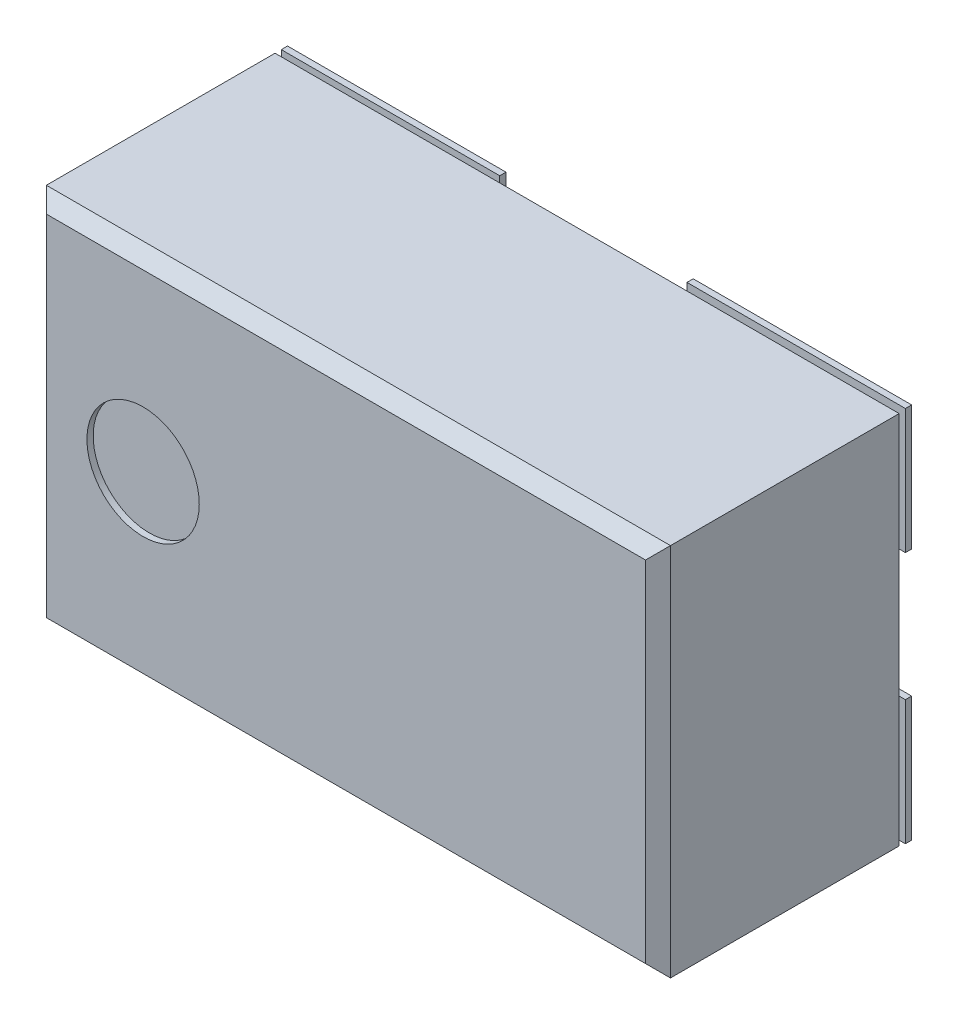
ISO-10303-21;
HEADER;
FILE_DESCRIPTION(('STEP AP214'),'2;1');
FILE_NAME('part.step','',(''),(''),'','','');
FILE_SCHEMA(('AUTOMOTIVE_DESIGN { 1 0 10303 214 1 1 1 1 }'));
ENDSEC;
DATA;
#1=APPLICATION_CONTEXT('core data for automotive mechanical design processes');
#2=APPLICATION_PROTOCOL_DEFINITION('international standard','automotive_design',2000,#1);
#3=PRODUCT_CONTEXT('',#1,'mechanical');
#4=PRODUCT('Part','Part','',(#3));
#5=PRODUCT_RELATED_PRODUCT_CATEGORY('part','',(#4));
#6=PRODUCT_DEFINITION_FORMATION('','',#4);
#7=PRODUCT_DEFINITION_CONTEXT('part definition',#1,'design');
#8=PRODUCT_DEFINITION('design','',#6,#7);
#9=PRODUCT_DEFINITION_SHAPE('','',#8);
#10=(LENGTH_UNIT() NAMED_UNIT(*) SI_UNIT(.MILLI.,.METRE.));
#11=(NAMED_UNIT(*) PLANE_ANGLE_UNIT() SI_UNIT($,.RADIAN.));
#12=(NAMED_UNIT(*) SI_UNIT($,.STERADIAN.) SOLID_ANGLE_UNIT());
#13=UNCERTAINTY_MEASURE_WITH_UNIT(LENGTH_MEASURE(1.E-05),#10,'distance_accuracy_value','');
#14=(GEOMETRIC_REPRESENTATION_CONTEXT(3) GLOBAL_UNCERTAINTY_ASSIGNED_CONTEXT((#13)) GLOBAL_UNIT_ASSIGNED_CONTEXT((#10,
#11,#12)) REPRESENTATION_CONTEXT('',''));
#15=CARTESIAN_POINT('',(0.,0.,0.));
#16=DIRECTION('',(0.,0.,1.));
#17=DIRECTION('',(1.,0.,0.));
#18=AXIS2_PLACEMENT_3D('',#15,#16,#17);
#19=CARTESIAN_POINT('',(0.,0.,0.0762));
#20=DIRECTION('',(0.,0.,1.));
#21=DIRECTION('',(1.,0.,0.));
#22=AXIS2_PLACEMENT_3D('',#19,#20,#21);
#23=PLANE('',#22);
#24=DIRECTION('',(1.,0.,0.));
#25=VECTOR('',#24,1.);
#26=CARTESIAN_POINT('',(-0.500000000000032,-0.30000000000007,0.0762));
#27=LINE('',#26,#25);
#28=CARTESIAN_POINT('',(-0.500000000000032,-0.30000000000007,0.0762));
#29=VERTEX_POINT('',#28);
#30=CARTESIAN_POINT('',(-0.15000000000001,-0.30000000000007,0.0762));
#31=VERTEX_POINT('',#30);
#32=EDGE_CURVE('E504',#29,#31,#27,.T.);
#33=ORIENTED_EDGE('',*,*,#32,.F.);
#34=DIRECTION('',(0.,1.,0.));
#35=VECTOR('',#34,1.);
#36=CARTESIAN_POINT('',(-0.500000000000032,0.30000000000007,0.0762));
#37=LINE('',#36,#35);
#38=CARTESIAN_POINT('',(-0.500000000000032,0.30000000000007,0.0762));
#39=VERTEX_POINT('',#38);
#40=EDGE_CURVE('E509',#39,#29,#37,.F.);
#41=ORIENTED_EDGE('',*,*,#40,.F.);
#42=DIRECTION('',(1.,0.,0.));
#43=VECTOR('',#42,1.);
#44=CARTESIAN_POINT('',(-0.15000000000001,0.30000000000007,0.0762));
#45=LINE('',#44,#43);
#46=CARTESIAN_POINT('',(-0.15000000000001,0.30000000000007,0.0762));
#47=VERTEX_POINT('',#46);
#48=EDGE_CURVE('E471',#47,#39,#45,.F.);
#49=ORIENTED_EDGE('',*,*,#48,.F.);
#50=DIRECTION('',(0.,1.,0.));
#51=VECTOR('',#50,1.);
#52=CARTESIAN_POINT('',(-0.15000000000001,-0.30000000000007,0.0762));
#53=LINE('',#52,#51);
#54=EDGE_CURVE('E499',#31,#47,#53,.T.);
#55=ORIENTED_EDGE('',*,*,#54,.F.);
#56=EDGE_LOOP('',(#33,#41,#49,#55));
#57=FACE_BOUND('',#56,.T.);
#58=ADVANCED_FACE('F16',(#57),#23,.F.);
#59=CARTESIAN_POINT('',(-0.500000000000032,0.30000000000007,0.0762));
#60=DIRECTION('',(-1.,0.,0.));
#61=DIRECTION('',(0.,0.,1.));
#62=AXIS2_PLACEMENT_3D('',#59,#60,#61);
#63=PLANE('',#62);
#64=DIRECTION('',(0.,0.,1.));
#65=VECTOR('',#64,1.);
#66=CARTESIAN_POINT('',(-0.500000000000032,0.30000000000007,0.0762));
#67=LINE('',#66,#65);
#68=CARTESIAN_POINT('',(-0.500000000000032,0.30000000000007,0.0862000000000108));
#69=VERTEX_POINT('',#68);
#70=EDGE_CURVE('E496',#39,#69,#67,.T.);
#71=ORIENTED_EDGE('',*,*,#70,.F.);
#72=ORIENTED_EDGE('',*,*,#40,.T.);
#73=DIRECTION('',(0.,0.,-1.));
#74=VECTOR('',#73,1.);
#75=CARTESIAN_POINT('',(-0.500000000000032,-0.30000000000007,0.0762));
#76=LINE('',#75,#74);
#77=CARTESIAN_POINT('',(-0.500000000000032,-0.30000000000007,0.0862000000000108));
#78=VERTEX_POINT('',#77);
#79=EDGE_CURVE('E506',#78,#29,#76,.T.);
#80=ORIENTED_EDGE('',*,*,#79,.F.);
#81=DIRECTION('',(0.,1.,0.));
#82=VECTOR('',#81,1.);
#83=CARTESIAN_POINT('',(-0.500000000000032,0.,0.0862000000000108));
#84=LINE('',#83,#82);
#85=EDGE_CURVE('E406',#69,#78,#84,.F.);
#86=ORIENTED_EDGE('',*,*,#85,.F.);
#87=EDGE_LOOP('',(#71,#72,#80,#86));
#88=FACE_BOUND('',#87,.T.);
#89=ADVANCED_FACE('F809',(#88),#63,.T.);
#90=CARTESIAN_POINT('',(-0.500000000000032,-0.30000000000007,0.0762));
#91=DIRECTION('',(0.,-1.,0.));
#92=DIRECTION('',(0.,0.,-1.));
#93=AXIS2_PLACEMENT_3D('',#90,#91,#92);
#94=PLANE('',#93);
#95=ORIENTED_EDGE('',*,*,#79,.T.);
#96=ORIENTED_EDGE('',*,*,#32,.T.);
#97=DIRECTION('',(0.,0.,-1.));
#98=VECTOR('',#97,1.);
#99=CARTESIAN_POINT('',(-0.15000000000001,-0.30000000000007,0.0762));
#100=LINE('',#99,#98);
#101=CARTESIAN_POINT('',(-0.15000000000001,-0.30000000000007,0.0862000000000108));
#102=VERTEX_POINT('',#101);
#103=EDGE_CURVE('E501',#102,#31,#100,.T.);
#104=ORIENTED_EDGE('',*,*,#103,.F.);
#105=DIRECTION('',(1.,0.,0.));
#106=VECTOR('',#105,1.);
#107=CARTESIAN_POINT('',(0.,-0.30000000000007,0.0862000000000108));
#108=LINE('',#107,#106);
#109=EDGE_CURVE('E403',#78,#102,#108,.T.);
#110=ORIENTED_EDGE('',*,*,#109,.F.);
#111=EDGE_LOOP('',(#95,#96,#104,#110));
#112=FACE_BOUND('',#111,.T.);
#113=ADVANCED_FACE('F806',(#112),#94,.T.);
#114=CARTESIAN_POINT('',(-0.15000000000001,-0.30000000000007,0.0762));
#115=DIRECTION('',(1.,0.,0.));
#116=DIRECTION('',(0.,0.,-1.));
#117=AXIS2_PLACEMENT_3D('',#114,#115,#116);
#118=PLANE('',#117);
#119=ORIENTED_EDGE('',*,*,#103,.T.);
#120=ORIENTED_EDGE('',*,*,#54,.T.);
#121=DIRECTION('',(0.,0.,1.));
#122=VECTOR('',#121,1.);
#123=CARTESIAN_POINT('',(-0.15000000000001,0.30000000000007,0.0762));
#124=LINE('',#123,#122);
#125=CARTESIAN_POINT('',(-0.15000000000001,0.30000000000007,0.0862000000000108));
#126=VERTEX_POINT('',#125);
#127=EDGE_CURVE('E493',#126,#47,#124,.F.);
#128=ORIENTED_EDGE('',*,*,#127,.F.);
#129=DIRECTION('',(0.,1.,0.));
#130=VECTOR('',#129,1.);
#131=CARTESIAN_POINT('',(-0.15000000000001,0.,0.0862000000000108));
#132=LINE('',#131,#130);
#133=EDGE_CURVE('E400',#102,#126,#132,.T.);
#134=ORIENTED_EDGE('',*,*,#133,.F.);
#135=EDGE_LOOP('',(#119,#120,#128,#134));
#136=FACE_BOUND('',#135,.T.);
#137=ADVANCED_FACE('F802',(#136),#118,.T.);
#138=CARTESIAN_POINT('',(-0.15000000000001,0.30000000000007,0.0762));
#139=DIRECTION('',(0.,1.,0.));
#140=DIRECTION('',(0.,0.,1.));
#141=AXIS2_PLACEMENT_3D('',#138,#139,#140);
#142=PLANE('',#141);
#143=ORIENTED_EDGE('',*,*,#127,.T.);
#144=ORIENTED_EDGE('',*,*,#48,.T.);
#145=ORIENTED_EDGE('',*,*,#70,.T.);
#146=DIRECTION('',(1.,0.,0.));
#147=VECTOR('',#146,1.);
#148=CARTESIAN_POINT('',(0.,0.30000000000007,0.0862000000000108));
#149=LINE('',#148,#147);
#150=EDGE_CURVE('E396',#126,#69,#149,.F.);
#151=ORIENTED_EDGE('',*,*,#150,.F.);
#152=EDGE_LOOP('',(#143,#144,#145,#151));
#153=FACE_BOUND('',#152,.T.);
#154=ADVANCED_FACE('F798',(#153),#142,.T.);
#155=CARTESIAN_POINT('',(0.500000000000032,0.101999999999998,0.0762));
#156=DIRECTION('',(1.,0.,0.));
#157=DIRECTION('',(0.,0.,-1.));
#158=AXIS2_PLACEMENT_3D('',#155,#156,#157);
#159=PLANE('',#158);
#160=DIRECTION('',(0.,0.,-1.));
#161=VECTOR('',#160,1.);
#162=CARTESIAN_POINT('',(0.500000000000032,0.101999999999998,0.0762));
#163=LINE('',#162,#161);
#164=CARTESIAN_POINT('',(0.500000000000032,0.101999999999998,0.0762));
#165=VERTEX_POINT('',#164);
#166=CARTESIAN_POINT('',(0.500000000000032,0.101999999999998,0.0862000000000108));
#167=VERTEX_POINT('',#166);
#168=EDGE_CURVE('E399',#165,#167,#163,.F.);
#169=ORIENTED_EDGE('',*,*,#168,.F.);
#170=DIRECTION('',(0.,1.,0.));
#171=VECTOR('',#170,1.);
#172=CARTESIAN_POINT('',(0.500000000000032,0.,0.0762));
#173=LINE('',#172,#171);
#174=CARTESIAN_POINT('',(0.500000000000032,0.302000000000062,0.0762));
#175=VERTEX_POINT('',#174);
#176=EDGE_CURVE('E247',#165,#175,#173,.T.);
#177=ORIENTED_EDGE('',*,*,#176,.T.);
#178=DIRECTION('',(0.,0.,1.));
#179=VECTOR('',#178,1.);
#180=CARTESIAN_POINT('',(0.500000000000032,0.302000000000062,0.0762));
#181=LINE('',#180,#179);
#182=CARTESIAN_POINT('',(0.500000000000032,0.302000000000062,0.0862000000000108));
#183=VERTEX_POINT('',#182);
#184=EDGE_CURVE('E462',#183,#175,#181,.F.);
#185=ORIENTED_EDGE('',*,*,#184,.F.);
#186=DIRECTION('',(0.,1.,0.));
#187=VECTOR('',#186,1.);
#188=CARTESIAN_POINT('',(0.500000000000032,0.,0.0862000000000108));
#189=LINE('',#188,#187);
#190=EDGE_CURVE('E389',#167,#183,#189,.T.);
#191=ORIENTED_EDGE('',*,*,#190,.F.);
#192=EDGE_LOOP('',(#169,#177,#185,#191));
#193=FACE_BOUND('',#192,.T.);
#194=ADVANCED_FACE('F794',(#193),#159,.T.);
#195=CARTESIAN_POINT('',(0.500000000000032,0.302000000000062,0.0762));
#196=DIRECTION('',(0.,1.,0.));
#197=DIRECTION('',(0.,0.,1.));
#198=AXIS2_PLACEMENT_3D('',#195,#196,#197);
#199=PLANE('',#198);
#200=ORIENTED_EDGE('',*,*,#184,.T.);
#201=DIRECTION('',(1.,0.,0.));
#202=VECTOR('',#201,1.);
#203=CARTESIAN_POINT('',(0.,0.302000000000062,0.0762));
#204=LINE('',#203,#202);
#205=CARTESIAN_POINT('',(0.15000000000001,0.302000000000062,0.0762));
#206=VERTEX_POINT('',#205);
#207=EDGE_CURVE('E482',#175,#206,#204,.F.);
#208=ORIENTED_EDGE('',*,*,#207,.T.);
#209=DIRECTION('',(0.,0.,1.));
#210=VECTOR('',#209,1.);
#211=CARTESIAN_POINT('',(0.15000000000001,0.302000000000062,0.0762));
#212=LINE('',#211,#210);
#213=CARTESIAN_POINT('',(0.15000000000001,0.302000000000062,0.0862000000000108));
#214=VERTEX_POINT('',#213);
#215=EDGE_CURVE('E431',#214,#206,#212,.F.);
#216=ORIENTED_EDGE('',*,*,#215,.F.);
#217=DIRECTION('',(1.,0.,0.));
#218=VECTOR('',#217,1.);
#219=CARTESIAN_POINT('',(0.,0.302000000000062,0.0862000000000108));
#220=LINE('',#219,#218);
#221=EDGE_CURVE('E457',#183,#214,#220,.F.);
#222=ORIENTED_EDGE('',*,*,#221,.F.);
#223=EDGE_LOOP('',(#200,#208,#216,#222));
#224=FACE_BOUND('',#223,.T.);
#225=ADVANCED_FACE('F790',(#224),#199,.T.);
#226=CARTESIAN_POINT('',(0.15000000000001,0.302000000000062,0.0762));
#227=DIRECTION('',(-1.,0.,0.));
#228=DIRECTION('',(0.,0.,1.));
#229=AXIS2_PLACEMENT_3D('',#226,#227,#228);
#230=PLANE('',#229);
#231=ORIENTED_EDGE('',*,*,#215,.T.);
#232=DIRECTION('',(0.,1.,0.));
#233=VECTOR('',#232,1.);
#234=CARTESIAN_POINT('',(0.15000000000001,0.,0.0762));
#235=LINE('',#234,#233);
#236=CARTESIAN_POINT('',(0.15000000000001,0.101999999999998,0.0762));
#237=VERTEX_POINT('',#236);
#238=EDGE_CURVE('E365',#206,#237,#235,.F.);
#239=ORIENTED_EDGE('',*,*,#238,.T.);
#240=DIRECTION('',(0.,0.,-1.));
#241=VECTOR('',#240,1.);
#242=CARTESIAN_POINT('',(0.15000000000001,0.101999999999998,0.0762));
#243=LINE('',#242,#241);
#244=CARTESIAN_POINT('',(0.15000000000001,0.101999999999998,0.0862000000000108));
#245=VERTEX_POINT('',#244);
#246=EDGE_CURVE('E249',#245,#237,#243,.T.);
#247=ORIENTED_EDGE('',*,*,#246,.F.);
#248=DIRECTION('',(0.,1.,0.));
#249=VECTOR('',#248,1.);
#250=CARTESIAN_POINT('',(0.15000000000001,0.,0.0862000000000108));
#251=LINE('',#250,#249);
#252=EDGE_CURVE('E374',#214,#245,#251,.F.);
#253=ORIENTED_EDGE('',*,*,#252,.F.);
#254=EDGE_LOOP('',(#231,#239,#247,#253));
#255=FACE_BOUND('',#254,.T.);
#256=ADVANCED_FACE('F786',(#255),#230,.T.);
#257=CARTESIAN_POINT('',(0.15000000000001,-0.101999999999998,0.0762));
#258=DIRECTION('',(-1.,0.,0.));
#259=DIRECTION('',(0.,0.,1.));
#260=AXIS2_PLACEMENT_3D('',#257,#258,#259);
#261=PLANE('',#260);
#262=DIRECTION('',(0.,0.,1.));
#263=VECTOR('',#262,1.);
#264=CARTESIAN_POINT('',(0.15000000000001,-0.101999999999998,0.0762));
#265=LINE('',#264,#263);
#266=CARTESIAN_POINT('',(0.15000000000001,-0.101999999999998,0.0762));
#267=VERTEX_POINT('',#266);
#268=CARTESIAN_POINT('',(0.15000000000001,-0.101999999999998,0.0862000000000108));
#269=VERTEX_POINT('',#268);
#270=EDGE_CURVE('E295',#267,#269,#265,.T.);
#271=ORIENTED_EDGE('',*,*,#270,.F.);
#272=DIRECTION('',(0.,1.,0.));
#273=VECTOR('',#272,1.);
#274=CARTESIAN_POINT('',(0.15000000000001,0.,0.0762));
#275=LINE('',#274,#273);
#276=CARTESIAN_POINT('',(0.15000000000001,-0.302000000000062,0.0762));
#277=VERTEX_POINT('',#276);
#278=EDGE_CURVE('E412',#267,#277,#275,.F.);
#279=ORIENTED_EDGE('',*,*,#278,.T.);
#280=DIRECTION('',(0.,0.,-1.));
#281=VECTOR('',#280,1.);
#282=CARTESIAN_POINT('',(0.15000000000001,-0.302000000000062,0.0762));
#283=LINE('',#282,#281);
#284=CARTESIAN_POINT('',(0.15000000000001,-0.302000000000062,0.0862000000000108));
#285=VERTEX_POINT('',#284);
#286=EDGE_CURVE('E422',#285,#277,#283,.T.);
#287=ORIENTED_EDGE('',*,*,#286,.F.);
#288=DIRECTION('',(0.,1.,0.));
#289=VECTOR('',#288,1.);
#290=CARTESIAN_POINT('',(0.15000000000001,0.,0.0862000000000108));
#291=LINE('',#290,#289);
#292=EDGE_CURVE('E308',#269,#285,#291,.F.);
#293=ORIENTED_EDGE('',*,*,#292,.F.);
#294=EDGE_LOOP('',(#271,#279,#287,#293));
#295=FACE_BOUND('',#294,.T.);
#296=ADVANCED_FACE('F782',(#295),#261,.T.);
#297=CARTESIAN_POINT('',(0.15000000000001,-0.302000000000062,0.0762));
#298=DIRECTION('',(0.,-1.,0.));
#299=DIRECTION('',(0.,0.,-1.));
#300=AXIS2_PLACEMENT_3D('',#297,#298,#299);
#301=PLANE('',#300);
#302=ORIENTED_EDGE('',*,*,#286,.T.);
#303=DIRECTION('',(1.,0.,0.));
#304=VECTOR('',#303,1.);
#305=CARTESIAN_POINT('',(0.,-0.302000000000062,0.0762));
#306=LINE('',#305,#304);
#307=CARTESIAN_POINT('',(0.500000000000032,-0.302000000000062,0.0762));
#308=VERTEX_POINT('',#307);
#309=EDGE_CURVE('E442',#277,#308,#306,.T.);
#310=ORIENTED_EDGE('',*,*,#309,.T.);
#311=DIRECTION('',(0.,0.,-1.));
#312=VECTOR('',#311,1.);
#313=CARTESIAN_POINT('',(0.500000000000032,-0.302000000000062,0.0762));
#314=LINE('',#313,#312);
#315=CARTESIAN_POINT('',(0.500000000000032,-0.302000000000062,0.0862000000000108));
#316=VERTEX_POINT('',#315);
#317=EDGE_CURVE('E409',#316,#308,#314,.T.);
#318=ORIENTED_EDGE('',*,*,#317,.F.);
#319=DIRECTION('',(1.,0.,0.));
#320=VECTOR('',#319,1.);
#321=CARTESIAN_POINT('',(0.,-0.302000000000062,0.0862000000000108));
#322=LINE('',#321,#320);
#323=EDGE_CURVE('E417',#285,#316,#322,.T.);
#324=ORIENTED_EDGE('',*,*,#323,.F.);
#325=EDGE_LOOP('',(#302,#310,#318,#324));
#326=FACE_BOUND('',#325,.T.);
#327=ADVANCED_FACE('F778',(#326),#301,.T.);
#328=CARTESIAN_POINT('',(0.500000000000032,-0.302000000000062,0.0762));
#329=DIRECTION('',(1.,0.,0.));
#330=DIRECTION('',(0.,0.,-1.));
#331=AXIS2_PLACEMENT_3D('',#328,#329,#330);
#332=PLANE('',#331);
#333=ORIENTED_EDGE('',*,*,#317,.T.);
#334=DIRECTION('',(0.,1.,0.));
#335=VECTOR('',#334,1.);
#336=CARTESIAN_POINT('',(0.500000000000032,0.,0.0762));
#337=LINE('',#336,#335);
#338=CARTESIAN_POINT('',(0.500000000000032,-0.101999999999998,0.0762));
#339=VERTEX_POINT('',#338);
#340=EDGE_CURVE('E312',#308,#339,#337,.T.);
#341=ORIENTED_EDGE('',*,*,#340,.T.);
#342=DIRECTION('',(0.,0.,1.));
#343=VECTOR('',#342,1.);
#344=CARTESIAN_POINT('',(0.500000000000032,-0.101999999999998,0.0762));
#345=LINE('',#344,#343);
#346=CARTESIAN_POINT('',(0.500000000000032,-0.101999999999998,0.0862000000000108));
#347=VERTEX_POINT('',#346);
#348=EDGE_CURVE('E373',#347,#339,#345,.F.);
#349=ORIENTED_EDGE('',*,*,#348,.F.);
#350=DIRECTION('',(0.,1.,0.));
#351=VECTOR('',#350,1.);
#352=CARTESIAN_POINT('',(0.500000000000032,0.,0.0862000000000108));
#353=LINE('',#352,#351);
#354=EDGE_CURVE('E343',#316,#347,#353,.T.);
#355=ORIENTED_EDGE('',*,*,#354,.F.);
#356=EDGE_LOOP('',(#333,#341,#349,#355));
#357=FACE_BOUND('',#356,.T.);
#358=ADVANCED_FACE('F774',(#357),#332,.T.);
#359=CARTESIAN_POINT('',(0.,0.,0.0862000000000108));
#360=DIRECTION('',(0.,0.,1.));
#361=DIRECTION('',(1.,0.,0.));
#362=AXIS2_PLACEMENT_3D('',#359,#360,#361);
#363=PLANE('',#362);
#364=DIRECTION('',(1.,0.,0.));
#365=VECTOR('',#364,1.);
#366=CARTESIAN_POINT('',(-0.449999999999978,-0.249999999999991,0.0862000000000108));
#367=LINE('',#366,#365);
#368=CARTESIAN_POINT('',(-0.449999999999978,-0.249999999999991,0.0862000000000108));
#369=VERTEX_POINT('',#368);
#370=CARTESIAN_POINT('',(-0.199999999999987,-0.249999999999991,0.0862000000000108));
#371=VERTEX_POINT('',#370);
#372=EDGE_CURVE('E289',#369,#371,#367,.T.);
#373=ORIENTED_EDGE('',*,*,#372,.F.);
#374=DIRECTION('',(0.,1.,0.));
#375=VECTOR('',#374,1.);
#376=CARTESIAN_POINT('',(-0.449999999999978,0.249999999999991,0.0862000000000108));
#377=LINE('',#376,#375);
#378=CARTESIAN_POINT('',(-0.449999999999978,0.249999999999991,0.0862000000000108));
#379=VERTEX_POINT('',#378);
#380=EDGE_CURVE('E264',#379,#369,#377,.F.);
#381=ORIENTED_EDGE('',*,*,#380,.F.);
#382=DIRECTION('',(1.,0.,0.));
#383=VECTOR('',#382,1.);
#384=CARTESIAN_POINT('',(-0.199999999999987,0.249999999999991,0.0862000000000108));
#385=LINE('',#384,#383);
#386=CARTESIAN_POINT('',(-0.199999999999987,0.249999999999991,0.0862000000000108));
#387=VERTEX_POINT('',#386);
#388=EDGE_CURVE('E279',#387,#379,#385,.F.);
#389=ORIENTED_EDGE('',*,*,#388,.F.);
#390=DIRECTION('',(0.,1.,0.));
#391=VECTOR('',#390,1.);
#392=CARTESIAN_POINT('',(-0.199999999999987,-0.249999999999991,0.0862000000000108));
#393=LINE('',#392,#391);
#394=EDGE_CURVE('E284',#371,#387,#393,.T.);
#395=ORIENTED_EDGE('',*,*,#394,.F.);
#396=EDGE_LOOP('',(#373,#381,#389,#395));
#397=FACE_BOUND('',#396,.T.);
#398=ORIENTED_EDGE('',*,*,#133,.T.);
#399=ORIENTED_EDGE('',*,*,#150,.T.);
#400=ORIENTED_EDGE('',*,*,#85,.T.);
#401=ORIENTED_EDGE('',*,*,#109,.T.);
#402=EDGE_LOOP('',(#398,#399,#400,#401));
#403=FACE_BOUND('',#402,.T.);
#404=ADVANCED_FACE('F771',(#397,#403),#363,.T.);
#405=CARTESIAN_POINT('',(0.15000000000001,0.101999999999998,0.0762));
#406=DIRECTION('',(0.,-1.,0.));
#407=DIRECTION('',(0.,0.,-1.));
#408=AXIS2_PLACEMENT_3D('',#405,#406,#407);
#409=PLANE('',#408);
#410=DIRECTION('',(1.,0.,0.));
#411=VECTOR('',#410,1.);
#412=CARTESIAN_POINT('',(0.,0.101999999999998,0.0862000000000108));
#413=LINE('',#412,#411);
#414=CARTESIAN_POINT('',(0.449999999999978,0.101999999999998,0.0862000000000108));
#415=VERTEX_POINT('',#414);
#416=EDGE_CURVE('E255',#415,#167,#413,.T.);
#417=ORIENTED_EDGE('',*,*,#416,.F.);
#418=DIRECTION('',(0.,0.,-1.));
#419=VECTOR('',#418,1.);
#420=CARTESIAN_POINT('',(0.449999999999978,0.101999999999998,0.0762));
#421=LINE('',#420,#419);
#422=CARTESIAN_POINT('',(0.449999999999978,0.101999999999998,0.0762));
#423=VERTEX_POINT('',#422);
#424=EDGE_CURVE('E252',#423,#415,#421,.F.);
#425=ORIENTED_EDGE('',*,*,#424,.F.);
#426=DIRECTION('',(1.,0.,0.));
#427=VECTOR('',#426,1.);
#428=CARTESIAN_POINT('',(0.,0.101999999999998,0.0762));
#429=LINE('',#428,#427);
#430=EDGE_CURVE('E240',#423,#165,#429,.T.);
#431=ORIENTED_EDGE('',*,*,#430,.T.);
#432=ORIENTED_EDGE('',*,*,#168,.T.);
#433=EDGE_LOOP('',(#417,#425,#431,#432));
#434=FACE_BOUND('',#433,.T.);
#435=ADVANCED_FACE('F253',(#434),#409,.T.);
#436=CARTESIAN_POINT('',(0.15000000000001,0.101999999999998,0.0762));
#437=DIRECTION('',(0.,-1.,0.));
#438=DIRECTION('',(0.,0.,-1.));
#439=AXIS2_PLACEMENT_3D('',#436,#437,#438);
#440=PLANE('',#439);
#441=DIRECTION('',(1.,0.,0.));
#442=VECTOR('',#441,1.);
#443=CARTESIAN_POINT('',(0.,0.101999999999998,0.0762));
#444=LINE('',#443,#442);
#445=CARTESIAN_POINT('',(0.199999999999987,0.101999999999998,0.0762));
#446=VERTEX_POINT('',#445);
#447=EDGE_CURVE('E363',#237,#446,#444,.T.);
#448=ORIENTED_EDGE('',*,*,#447,.T.);
#449=DIRECTION('',(0.,0.,1.));
#450=VECTOR('',#449,1.);
#451=CARTESIAN_POINT('',(0.199999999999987,0.101999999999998,0.0762));
#452=LINE('',#451,#450);
#453=CARTESIAN_POINT('',(0.199999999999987,0.101999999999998,0.0862000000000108));
#454=VERTEX_POINT('',#453);
#455=EDGE_CURVE('E522',#454,#446,#452,.F.);
#456=ORIENTED_EDGE('',*,*,#455,.F.);
#457=DIRECTION('',(1.,0.,0.));
#458=VECTOR('',#457,1.);
#459=CARTESIAN_POINT('',(0.,0.101999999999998,0.0862000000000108));
#460=LINE('',#459,#458);
#461=EDGE_CURVE('E370',#245,#454,#460,.T.);
#462=ORIENTED_EDGE('',*,*,#461,.F.);
#463=ORIENTED_EDGE('',*,*,#246,.T.);
#464=EDGE_LOOP('',(#448,#456,#462,#463));
#465=FACE_BOUND('',#464,.T.);
#466=ADVANCED_FACE('F765',(#465),#440,.T.);
#467=CARTESIAN_POINT('',(0.,0.,0.0762));
#468=DIRECTION('',(0.,0.,1.));
#469=DIRECTION('',(1.,0.,0.));
#470=AXIS2_PLACEMENT_3D('',#467,#468,#469);
#471=PLANE('',#470);
#472=DIRECTION('',(0.,1.,0.));
#473=VECTOR('',#472,1.);
#474=CARTESIAN_POINT('',(0.199999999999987,0.249999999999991,0.0762));
#475=LINE('',#474,#473);
#476=CARTESIAN_POINT('',(0.199999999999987,0.100000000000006,0.0762));
#477=VERTEX_POINT('',#476);
#478=EDGE_CURVE('E519',#446,#477,#475,.F.);
#479=ORIENTED_EDGE('',*,*,#478,.F.);
#480=ORIENTED_EDGE('',*,*,#447,.F.);
#481=ORIENTED_EDGE('',*,*,#238,.F.);
#482=ORIENTED_EDGE('',*,*,#207,.F.);
#483=ORIENTED_EDGE('',*,*,#176,.F.);
#484=ORIENTED_EDGE('',*,*,#430,.F.);
#485=DIRECTION('',(0.,1.,0.));
#486=VECTOR('',#485,1.);
#487=CARTESIAN_POINT('',(0.449999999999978,0.100000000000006,0.0762));
#488=LINE('',#487,#486);
#489=CARTESIAN_POINT('',(0.449999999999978,0.100000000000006,0.0762));
#490=VERTEX_POINT('',#489);
#491=EDGE_CURVE('E19',#490,#423,#488,.T.);
#492=ORIENTED_EDGE('',*,*,#491,.F.);
#493=DIRECTION('',(1.,0.,0.));
#494=VECTOR('',#493,1.);
#495=CARTESIAN_POINT('',(0.199999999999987,0.100000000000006,0.0762));
#496=LINE('',#495,#494);
#497=EDGE_CURVE('E234',#477,#490,#496,.T.);
#498=ORIENTED_EDGE('',*,*,#497,.F.);
#499=EDGE_LOOP('',(#479,#480,#481,#482,#483,#484,#492,#498));
#500=FACE_BOUND('',#499,.T.);
#501=ADVANCED_FACE('F243',(#500),#471,.F.);
#502=CARTESIAN_POINT('',(0.,0.,0.0862000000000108));
#503=DIRECTION('',(0.,0.,1.));
#504=DIRECTION('',(1.,0.,0.));
#505=AXIS2_PLACEMENT_3D('',#502,#503,#504);
#506=PLANE('',#505);
#507=ORIENTED_EDGE('',*,*,#461,.T.);
#508=DIRECTION('',(0.,1.,0.));
#509=VECTOR('',#508,1.);
#510=CARTESIAN_POINT('',(0.199999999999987,0.249999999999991,0.0862000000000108));
#511=LINE('',#510,#509);
#512=CARTESIAN_POINT('',(0.199999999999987,0.249999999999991,0.0862000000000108));
#513=VERTEX_POINT('',#512);
#514=EDGE_CURVE('E377',#513,#454,#511,.F.);
#515=ORIENTED_EDGE('',*,*,#514,.F.);
#516=DIRECTION('',(1.,0.,0.));
#517=VECTOR('',#516,1.);
#518=CARTESIAN_POINT('',(0.449999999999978,0.249999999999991,0.0862000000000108));
#519=LINE('',#518,#517);
#520=CARTESIAN_POINT('',(0.449999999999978,0.249999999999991,0.0862000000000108));
#521=VERTEX_POINT('',#520);
#522=EDGE_CURVE('E527',#521,#513,#519,.F.);
#523=ORIENTED_EDGE('',*,*,#522,.F.);
#524=DIRECTION('',(0.,1.,0.));
#525=VECTOR('',#524,1.);
#526=CARTESIAN_POINT('',(0.449999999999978,0.100000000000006,0.0862000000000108));
#527=LINE('',#526,#525);
#528=EDGE_CURVE('E258',#415,#521,#527,.T.);
#529=ORIENTED_EDGE('',*,*,#528,.F.);
#530=ORIENTED_EDGE('',*,*,#416,.T.);
#531=ORIENTED_EDGE('',*,*,#190,.T.);
#532=ORIENTED_EDGE('',*,*,#221,.T.);
#533=ORIENTED_EDGE('',*,*,#252,.T.);
#534=EDGE_LOOP('',(#507,#515,#523,#529,#530,#531,#532,#533));
#535=FACE_BOUND('',#534,.T.);
#536=ADVANCED_FACE('F543',(#535),#506,.T.);
#537=CARTESIAN_POINT('',(0.500000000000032,-0.101999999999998,0.0762));
#538=DIRECTION('',(0.,1.,0.));
#539=DIRECTION('',(0.,0.,1.));
#540=AXIS2_PLACEMENT_3D('',#537,#538,#539);
#541=PLANE('',#540);
#542=DIRECTION('',(1.,0.,0.));
#543=VECTOR('',#542,1.);
#544=CARTESIAN_POINT('',(0.,-0.101999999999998,0.0762));
#545=LINE('',#544,#543);
#546=CARTESIAN_POINT('',(0.449999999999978,-0.101999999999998,0.0762));
#547=VERTEX_POINT('',#546);
#548=EDGE_CURVE('E296',#339,#547,#545,.F.);
#549=ORIENTED_EDGE('',*,*,#548,.T.);
#550=DIRECTION('',(0.,0.,-1.));
#551=VECTOR('',#550,1.);
#552=CARTESIAN_POINT('',(0.449999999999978,-0.101999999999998,0.0762));
#553=LINE('',#552,#551);
#554=CARTESIAN_POINT('',(0.449999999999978,-0.101999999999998,0.0862000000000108));
#555=VERTEX_POINT('',#554);
#556=EDGE_CURVE('E380',#555,#547,#553,.T.);
#557=ORIENTED_EDGE('',*,*,#556,.F.);
#558=DIRECTION('',(1.,0.,0.));
#559=VECTOR('',#558,1.);
#560=CARTESIAN_POINT('',(0.,-0.101999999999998,0.0862000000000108));
#561=LINE('',#560,#559);
#562=EDGE_CURVE('E291',#347,#555,#561,.F.);
#563=ORIENTED_EDGE('',*,*,#562,.F.);
#564=ORIENTED_EDGE('',*,*,#348,.T.);
#565=EDGE_LOOP('',(#549,#557,#563,#564));
#566=FACE_BOUND('',#565,.T.);
#567=ADVANCED_FACE('F756',(#566),#541,.T.);
#568=CARTESIAN_POINT('',(0.,0.,0.0762));
#569=DIRECTION('',(0.,0.,1.));
#570=DIRECTION('',(1.,0.,0.));
#571=AXIS2_PLACEMENT_3D('',#568,#569,#570);
#572=PLANE('',#571);
#573=DIRECTION('',(0.,1.,0.));
#574=VECTOR('',#573,1.);
#575=CARTESIAN_POINT('',(0.449999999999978,-0.249999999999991,0.0762));
#576=LINE('',#575,#574);
#577=CARTESIAN_POINT('',(0.449999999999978,-0.100000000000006,0.0762));
#578=VERTEX_POINT('',#577);
#579=EDGE_CURVE('E348',#547,#578,#576,.T.);
#580=ORIENTED_EDGE('',*,*,#579,.F.);
#581=ORIENTED_EDGE('',*,*,#548,.F.);
#582=ORIENTED_EDGE('',*,*,#340,.F.);
#583=ORIENTED_EDGE('',*,*,#309,.F.);
#584=ORIENTED_EDGE('',*,*,#278,.F.);
#585=DIRECTION('',(1.,0.,0.));
#586=VECTOR('',#585,1.);
#587=CARTESIAN_POINT('',(0.500000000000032,-0.101999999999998,0.0762));
#588=LINE('',#587,#586);
#589=CARTESIAN_POINT('',(0.199999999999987,-0.101999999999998,0.0762));
#590=VERTEX_POINT('',#589);
#591=EDGE_CURVE('E292',#590,#267,#588,.F.);
#592=ORIENTED_EDGE('',*,*,#591,.F.);
#593=DIRECTION('',(0.,1.,0.));
#594=VECTOR('',#593,1.);
#595=CARTESIAN_POINT('',(0.199999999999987,-0.100000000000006,0.0762));
#596=LINE('',#595,#594);
#597=CARTESIAN_POINT('',(0.199999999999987,-0.100000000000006,0.0762));
#598=VERTEX_POINT('',#597);
#599=EDGE_CURVE('E516',#598,#590,#596,.F.);
#600=ORIENTED_EDGE('',*,*,#599,.F.);
#601=DIRECTION('',(1.,0.,0.));
#602=VECTOR('',#601,1.);
#603=CARTESIAN_POINT('',(0.449999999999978,-0.100000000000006,0.0762));
#604=LINE('',#603,#602);
#605=EDGE_CURVE('E315',#578,#598,#604,.F.);
#606=ORIENTED_EDGE('',*,*,#605,.F.);
#607=EDGE_LOOP('',(#580,#581,#582,#583,#584,#592,#600,#606));
#608=FACE_BOUND('',#607,.T.);
#609=ADVANCED_FACE('F752',(#608),#572,.F.);
#610=CARTESIAN_POINT('',(0.500000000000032,-0.101999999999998,0.0762));
#611=DIRECTION('',(0.,1.,0.));
#612=DIRECTION('',(0.,0.,1.));
#613=AXIS2_PLACEMENT_3D('',#610,#611,#612);
#614=PLANE('',#613);
#615=DIRECTION('',(1.,0.,0.));
#616=VECTOR('',#615,1.);
#617=CARTESIAN_POINT('',(0.,-0.101999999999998,0.0862000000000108));
#618=LINE('',#617,#616);
#619=CARTESIAN_POINT('',(0.199999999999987,-0.101999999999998,0.0862000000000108));
#620=VERTEX_POINT('',#619);
#621=EDGE_CURVE('E305',#620,#269,#618,.F.);
#622=ORIENTED_EDGE('',*,*,#621,.F.);
#623=DIRECTION('',(0.,0.,1.));
#624=VECTOR('',#623,1.);
#625=CARTESIAN_POINT('',(0.199999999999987,-0.101999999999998,0.0762));
#626=LINE('',#625,#624);
#627=EDGE_CURVE('E302',#590,#620,#626,.T.);
#628=ORIENTED_EDGE('',*,*,#627,.F.);
#629=ORIENTED_EDGE('',*,*,#591,.T.);
#630=ORIENTED_EDGE('',*,*,#270,.T.);
#631=EDGE_LOOP('',(#622,#628,#629,#630));
#632=FACE_BOUND('',#631,.T.);
#633=ADVANCED_FACE('F748',(#632),#614,.T.);
#634=CARTESIAN_POINT('',(0.,0.,0.0862000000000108));
#635=DIRECTION('',(0.,0.,1.));
#636=DIRECTION('',(1.,0.,0.));
#637=AXIS2_PLACEMENT_3D('',#634,#635,#636);
#638=PLANE('',#637);
#639=DIRECTION('',(0.,1.,0.));
#640=VECTOR('',#639,1.);
#641=CARTESIAN_POINT('',(0.449999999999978,-0.249999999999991,0.0862000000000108));
#642=LINE('',#641,#640);
#643=CARTESIAN_POINT('',(0.449999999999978,-0.249999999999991,0.0862000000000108));
#644=VERTEX_POINT('',#643);
#645=EDGE_CURVE('E333',#644,#555,#642,.T.);
#646=ORIENTED_EDGE('',*,*,#645,.F.);
#647=DIRECTION('',(1.,0.,0.));
#648=VECTOR('',#647,1.);
#649=CARTESIAN_POINT('',(0.199999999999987,-0.249999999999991,0.0862000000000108));
#650=LINE('',#649,#648);
#651=CARTESIAN_POINT('',(0.199999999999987,-0.249999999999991,0.0862000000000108));
#652=VERTEX_POINT('',#651);
#653=EDGE_CURVE('E567',#652,#644,#650,.T.);
#654=ORIENTED_EDGE('',*,*,#653,.F.);
#655=DIRECTION('',(0.,1.,0.));
#656=VECTOR('',#655,1.);
#657=CARTESIAN_POINT('',(0.199999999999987,-0.100000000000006,0.0862000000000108));
#658=LINE('',#657,#656);
#659=EDGE_CURVE('E299',#620,#652,#658,.F.);
#660=ORIENTED_EDGE('',*,*,#659,.F.);
#661=ORIENTED_EDGE('',*,*,#621,.T.);
#662=ORIENTED_EDGE('',*,*,#292,.T.);
#663=ORIENTED_EDGE('',*,*,#323,.T.);
#664=ORIENTED_EDGE('',*,*,#354,.T.);
#665=ORIENTED_EDGE('',*,*,#562,.T.);
#666=EDGE_LOOP('',(#646,#654,#660,#661,#662,#663,#664,#665));
#667=FACE_BOUND('',#666,.T.);
#668=ADVANCED_FACE('F744',(#667),#638,.T.);
#669=CARTESIAN_POINT('',(-0.449999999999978,-0.249999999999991,0.0762));
#670=DIRECTION('',(0.,-1.,0.));
#671=DIRECTION('',(0.,0.,-1.));
#672=AXIS2_PLACEMENT_3D('',#669,#670,#671);
#673=PLANE('',#672);
#674=DIRECTION('',(0.,0.,1.));
#675=VECTOR('',#674,1.);
#676=CARTESIAN_POINT('',(-0.449999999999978,-0.249999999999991,0.0762));
#677=LINE('',#676,#675);
#678=CARTESIAN_POINT('',(-0.449999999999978,-0.249999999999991,0.0961999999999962));
#679=VERTEX_POINT('',#678);
#680=EDGE_CURVE('E276',#369,#679,#677,.T.);
#681=ORIENTED_EDGE('',*,*,#680,.F.);
#682=ORIENTED_EDGE('',*,*,#372,.T.);
#683=DIRECTION('',(0.,0.,-1.));
#684=VECTOR('',#683,1.);
#685=CARTESIAN_POINT('',(-0.199999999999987,-0.249999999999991,0.0762));
#686=LINE('',#685,#684);
#687=CARTESIAN_POINT('',(-0.199999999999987,-0.249999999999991,0.0961999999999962));
#688=VERTEX_POINT('',#687);
#689=EDGE_CURVE('E286',#688,#371,#686,.T.);
#690=ORIENTED_EDGE('',*,*,#689,.F.);
#691=DIRECTION('',(-1.,0.,0.));
#692=VECTOR('',#691,1.);
#693=CARTESIAN_POINT('',(-0.500000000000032,-0.249999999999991,0.0961999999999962));
#694=LINE('',#693,#692);
#695=EDGE_CURVE('E570',#679,#688,#694,.F.);
#696=ORIENTED_EDGE('',*,*,#695,.F.);
#697=EDGE_LOOP('',(#681,#682,#690,#696));
#698=FACE_BOUND('',#697,.T.);
#699=ADVANCED_FACE('F740',(#698),#673,.T.);
#700=CARTESIAN_POINT('',(-0.199999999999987,-0.249999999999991,0.0762));
#701=DIRECTION('',(1.,0.,0.));
#702=DIRECTION('',(0.,0.,-1.));
#703=AXIS2_PLACEMENT_3D('',#700,#701,#702);
#704=PLANE('',#703);
#705=ORIENTED_EDGE('',*,*,#689,.T.);
#706=ORIENTED_EDGE('',*,*,#394,.T.);
#707=DIRECTION('',(0.,0.,1.));
#708=VECTOR('',#707,1.);
#709=CARTESIAN_POINT('',(-0.199999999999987,0.249999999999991,0.0762));
#710=LINE('',#709,#708);
#711=CARTESIAN_POINT('',(-0.199999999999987,0.249999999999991,0.0961999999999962));
#712=VERTEX_POINT('',#711);
#713=EDGE_CURVE('E281',#712,#387,#710,.F.);
#714=ORIENTED_EDGE('',*,*,#713,.F.);
#715=DIRECTION('',(0.,1.,0.));
#716=VECTOR('',#715,1.);
#717=CARTESIAN_POINT('',(-0.199999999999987,0.30000000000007,0.0961999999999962));
#718=LINE('',#717,#716);
#719=EDGE_CURVE('E573',#688,#712,#718,.T.);
#720=ORIENTED_EDGE('',*,*,#719,.F.);
#721=EDGE_LOOP('',(#705,#706,#714,#720));
#722=FACE_BOUND('',#721,.T.);
#723=ADVANCED_FACE('F736',(#722),#704,.T.);
#724=CARTESIAN_POINT('',(-0.199999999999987,0.249999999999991,0.0762));
#725=DIRECTION('',(0.,1.,0.));
#726=DIRECTION('',(0.,0.,1.));
#727=AXIS2_PLACEMENT_3D('',#724,#725,#726);
#728=PLANE('',#727);
#729=ORIENTED_EDGE('',*,*,#713,.T.);
#730=ORIENTED_EDGE('',*,*,#388,.T.);
#731=DIRECTION('',(0.,0.,1.));
#732=VECTOR('',#731,1.);
#733=CARTESIAN_POINT('',(-0.449999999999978,0.249999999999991,0.0762));
#734=LINE('',#733,#732);
#735=CARTESIAN_POINT('',(-0.449999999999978,0.249999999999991,0.0961999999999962));
#736=VERTEX_POINT('',#735);
#737=EDGE_CURVE('E273',#736,#379,#734,.F.);
#738=ORIENTED_EDGE('',*,*,#737,.F.);
#739=DIRECTION('',(-1.,0.,0.));
#740=VECTOR('',#739,1.);
#741=CARTESIAN_POINT('',(-0.500000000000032,0.249999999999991,0.0961999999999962));
#742=LINE('',#741,#740);
#743=EDGE_CURVE('E576',#712,#736,#742,.T.);
#744=ORIENTED_EDGE('',*,*,#743,.F.);
#745=EDGE_LOOP('',(#729,#730,#738,#744));
#746=FACE_BOUND('',#745,.T.);
#747=ADVANCED_FACE('F732',(#746),#728,.T.);
#748=CARTESIAN_POINT('',(-0.449999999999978,0.249999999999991,0.0762));
#749=DIRECTION('',(-1.,0.,0.));
#750=DIRECTION('',(0.,0.,1.));
#751=AXIS2_PLACEMENT_3D('',#748,#749,#750);
#752=PLANE('',#751);
#753=ORIENTED_EDGE('',*,*,#737,.T.);
#754=ORIENTED_EDGE('',*,*,#380,.T.);
#755=ORIENTED_EDGE('',*,*,#680,.T.);
#756=DIRECTION('',(0.,1.,0.));
#757=VECTOR('',#756,1.);
#758=CARTESIAN_POINT('',(-0.449999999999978,0.30000000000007,0.0961999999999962));
#759=LINE('',#758,#757);
#760=EDGE_CURVE('E355',#736,#679,#759,.F.);
#761=ORIENTED_EDGE('',*,*,#760,.F.);
#762=EDGE_LOOP('',(#753,#754,#755,#761));
#763=FACE_BOUND('',#762,.T.);
#764=ADVANCED_FACE('F729',(#763),#752,.T.);
#765=CARTESIAN_POINT('',(0.199999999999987,0.100000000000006,0.0762));
#766=DIRECTION('',(0.,-1.,0.));
#767=DIRECTION('',(0.,0.,-1.));
#768=AXIS2_PLACEMENT_3D('',#765,#766,#767);
#769=PLANE('',#768);
#770=DIRECTION('',(0.,0.,-1.));
#771=VECTOR('',#770,1.);
#772=CARTESIAN_POINT('',(0.449999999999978,0.100000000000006,0.0762));
#773=LINE('',#772,#771);
#774=CARTESIAN_POINT('',(0.449999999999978,0.100000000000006,0.0961999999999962));
#775=VERTEX_POINT('',#774);
#776=EDGE_CURVE('E262',#775,#490,#773,.T.);
#777=ORIENTED_EDGE('',*,*,#776,.F.);
#778=DIRECTION('',(-1.,0.,0.));
#779=VECTOR('',#778,1.);
#780=CARTESIAN_POINT('',(-0.500000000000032,0.100000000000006,0.0961999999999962));
#781=LINE('',#780,#779);
#782=CARTESIAN_POINT('',(0.199999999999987,0.100000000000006,0.0961999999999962));
#783=VERTEX_POINT('',#782);
#784=EDGE_CURVE('E351',#783,#775,#781,.F.);
#785=ORIENTED_EDGE('',*,*,#784,.F.);
#786=DIRECTION('',(0.,0.,1.));
#787=VECTOR('',#786,1.);
#788=CARTESIAN_POINT('',(0.199999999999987,0.100000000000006,0.0762));
#789=LINE('',#788,#787);
#790=EDGE_CURVE('E521',#477,#783,#789,.T.);
#791=ORIENTED_EDGE('',*,*,#790,.F.);
#792=ORIENTED_EDGE('',*,*,#497,.T.);
#793=EDGE_LOOP('',(#777,#785,#791,#792));
#794=FACE_BOUND('',#793,.T.);
#795=ADVANCED_FACE('F726',(#794),#769,.T.);
#796=CARTESIAN_POINT('',(0.449999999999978,0.100000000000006,0.0762));
#797=DIRECTION('',(1.,0.,0.));
#798=DIRECTION('',(0.,0.,-1.));
#799=AXIS2_PLACEMENT_3D('',#796,#797,#798);
#800=PLANE('',#799);
#801=ORIENTED_EDGE('',*,*,#424,.T.);
#802=ORIENTED_EDGE('',*,*,#528,.T.);
#803=DIRECTION('',(0.,0.,1.));
#804=VECTOR('',#803,1.);
#805=CARTESIAN_POINT('',(0.449999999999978,0.249999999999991,0.0762));
#806=LINE('',#805,#804);
#807=CARTESIAN_POINT('',(0.449999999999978,0.249999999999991,0.0961999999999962));
#808=VERTEX_POINT('',#807);
#809=EDGE_CURVE('E385',#808,#521,#806,.F.);
#810=ORIENTED_EDGE('',*,*,#809,.F.);
#811=DIRECTION('',(0.,1.,0.));
#812=VECTOR('',#811,1.);
#813=CARTESIAN_POINT('',(0.449999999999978,0.30000000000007,0.0961999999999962));
#814=LINE('',#813,#812);
#815=EDGE_CURVE('E354',#775,#808,#814,.T.);
#816=ORIENTED_EDGE('',*,*,#815,.F.);
#817=ORIENTED_EDGE('',*,*,#776,.T.);
#818=ORIENTED_EDGE('',*,*,#491,.T.);
#819=EDGE_LOOP('',(#801,#802,#810,#816,#817,#818));
#820=FACE_BOUND('',#819,.T.);
#821=ADVANCED_FACE('F260',(#820),#800,.T.);
#822=CARTESIAN_POINT('',(0.449999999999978,0.249999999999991,0.0762));
#823=DIRECTION('',(0.,1.,0.));
#824=DIRECTION('',(0.,0.,1.));
#825=AXIS2_PLACEMENT_3D('',#822,#823,#824);
#826=PLANE('',#825);
#827=ORIENTED_EDGE('',*,*,#809,.T.);
#828=ORIENTED_EDGE('',*,*,#522,.T.);
#829=DIRECTION('',(0.,0.,1.));
#830=VECTOR('',#829,1.);
#831=CARTESIAN_POINT('',(0.199999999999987,0.249999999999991,0.0762));
#832=LINE('',#831,#830);
#833=CARTESIAN_POINT('',(0.199999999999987,0.249999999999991,0.0961999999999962));
#834=VERTEX_POINT('',#833);
#835=EDGE_CURVE('E381',#834,#513,#832,.F.);
#836=ORIENTED_EDGE('',*,*,#835,.F.);
#837=DIRECTION('',(-1.,0.,0.));
#838=VECTOR('',#837,1.);
#839=CARTESIAN_POINT('',(-0.500000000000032,0.249999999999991,0.0961999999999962));
#840=LINE('',#839,#838);
#841=EDGE_CURVE('E360',#808,#834,#840,.T.);
#842=ORIENTED_EDGE('',*,*,#841,.F.);
#843=EDGE_LOOP('',(#827,#828,#836,#842));
#844=FACE_BOUND('',#843,.T.);
#845=ADVANCED_FACE('F538',(#844),#826,.T.);
#846=CARTESIAN_POINT('',(0.199999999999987,0.249999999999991,0.0762));
#847=DIRECTION('',(-1.,0.,0.));
#848=DIRECTION('',(0.,0.,1.));
#849=AXIS2_PLACEMENT_3D('',#846,#847,#848);
#850=PLANE('',#849);
#851=ORIENTED_EDGE('',*,*,#835,.T.);
#852=ORIENTED_EDGE('',*,*,#514,.T.);
#853=ORIENTED_EDGE('',*,*,#455,.T.);
#854=ORIENTED_EDGE('',*,*,#478,.T.);
#855=ORIENTED_EDGE('',*,*,#790,.T.);
#856=DIRECTION('',(0.,1.,0.));
#857=VECTOR('',#856,1.);
#858=CARTESIAN_POINT('',(0.199999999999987,0.30000000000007,0.0961999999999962));
#859=LINE('',#858,#857);
#860=EDGE_CURVE('E338',#834,#783,#859,.F.);
#861=ORIENTED_EDGE('',*,*,#860,.F.);
#862=EDGE_LOOP('',(#851,#852,#853,#854,#855,#861));
#863=FACE_BOUND('',#862,.T.);
#864=ADVANCED_FACE('F547',(#863),#850,.T.);
#865=CARTESIAN_POINT('',(0.449999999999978,-0.249999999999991,0.0762));
#866=DIRECTION('',(1.,0.,0.));
#867=DIRECTION('',(0.,0.,-1.));
#868=AXIS2_PLACEMENT_3D('',#865,#866,#867);
#869=PLANE('',#868);
#870=DIRECTION('',(0.,0.,-1.));
#871=VECTOR('',#870,1.);
#872=CARTESIAN_POINT('',(0.449999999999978,-0.249999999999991,0.0762));
#873=LINE('',#872,#871);
#874=CARTESIAN_POINT('',(0.449999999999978,-0.249999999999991,0.0961999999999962));
#875=VERTEX_POINT('',#874);
#876=EDGE_CURVE('E301',#644,#875,#873,.F.);
#877=ORIENTED_EDGE('',*,*,#876,.F.);
#878=ORIENTED_EDGE('',*,*,#645,.T.);
#879=ORIENTED_EDGE('',*,*,#556,.T.);
#880=ORIENTED_EDGE('',*,*,#579,.T.);
#881=DIRECTION('',(0.,0.,1.));
#882=VECTOR('',#881,1.);
#883=CARTESIAN_POINT('',(0.449999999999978,-0.100000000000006,0.0762));
#884=LINE('',#883,#882);
#885=CARTESIAN_POINT('',(0.449999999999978,-0.100000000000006,0.0961999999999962));
#886=VERTEX_POINT('',#885);
#887=EDGE_CURVE('E318',#886,#578,#884,.F.);
#888=ORIENTED_EDGE('',*,*,#887,.F.);
#889=DIRECTION('',(0.,1.,0.));
#890=VECTOR('',#889,1.);
#891=CARTESIAN_POINT('',(0.449999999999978,0.30000000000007,0.0961999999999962));
#892=LINE('',#891,#890);
#893=EDGE_CURVE('E328',#875,#886,#892,.T.);
#894=ORIENTED_EDGE('',*,*,#893,.F.);
#895=EDGE_LOOP('',(#877,#878,#879,#880,#888,#894));
#896=FACE_BOUND('',#895,.T.);
#897=ADVANCED_FACE('F715',(#896),#869,.T.);
#898=CARTESIAN_POINT('',(0.449999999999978,-0.100000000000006,0.0762));
#899=DIRECTION('',(0.,1.,0.));
#900=DIRECTION('',(0.,0.,1.));
#901=AXIS2_PLACEMENT_3D('',#898,#899,#900);
#902=PLANE('',#901);
#903=DIRECTION('',(0.,0.,1.));
#904=VECTOR('',#903,1.);
#905=CARTESIAN_POINT('',(0.199999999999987,-0.100000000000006,0.0762));
#906=LINE('',#905,#904);
#907=CARTESIAN_POINT('',(0.199999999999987,-0.100000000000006,0.0961999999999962));
#908=VERTEX_POINT('',#907);
#909=EDGE_CURVE('E317',#908,#598,#906,.F.);
#910=ORIENTED_EDGE('',*,*,#909,.F.);
#911=DIRECTION('',(-1.,0.,0.));
#912=VECTOR('',#911,1.);
#913=CARTESIAN_POINT('',(-0.500000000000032,-0.100000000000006,0.0961999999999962));
#914=LINE('',#913,#912);
#915=EDGE_CURVE('E323',#886,#908,#914,.T.);
#916=ORIENTED_EDGE('',*,*,#915,.F.);
#917=ORIENTED_EDGE('',*,*,#887,.T.);
#918=ORIENTED_EDGE('',*,*,#605,.T.);
#919=EDGE_LOOP('',(#910,#916,#917,#918));
#920=FACE_BOUND('',#919,.T.);
#921=ADVANCED_FACE('F711',(#920),#902,.T.);
#922=CARTESIAN_POINT('',(0.199999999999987,-0.100000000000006,0.0762));
#923=DIRECTION('',(-1.,0.,0.));
#924=DIRECTION('',(0.,0.,1.));
#925=AXIS2_PLACEMENT_3D('',#922,#923,#924);
#926=PLANE('',#925);
#927=ORIENTED_EDGE('',*,*,#627,.T.);
#928=ORIENTED_EDGE('',*,*,#659,.T.);
#929=DIRECTION('',(0.,0.,-1.));
#930=VECTOR('',#929,1.);
#931=CARTESIAN_POINT('',(0.199999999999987,-0.249999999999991,0.0762));
#932=LINE('',#931,#930);
#933=CARTESIAN_POINT('',(0.199999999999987,-0.249999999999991,0.0961999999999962));
#934=VERTEX_POINT('',#933);
#935=EDGE_CURVE('E564',#934,#652,#932,.T.);
#936=ORIENTED_EDGE('',*,*,#935,.F.);
#937=DIRECTION('',(0.,1.,0.));
#938=VECTOR('',#937,1.);
#939=CARTESIAN_POINT('',(0.199999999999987,0.30000000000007,0.0961999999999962));
#940=LINE('',#939,#938);
#941=EDGE_CURVE('E319',#908,#934,#940,.F.);
#942=ORIENTED_EDGE('',*,*,#941,.F.);
#943=ORIENTED_EDGE('',*,*,#909,.T.);
#944=ORIENTED_EDGE('',*,*,#599,.T.);
#945=EDGE_LOOP('',(#927,#928,#936,#942,#943,#944));
#946=FACE_BOUND('',#945,.T.);
#947=ADVANCED_FACE('F707',(#946),#926,.T.);
#948=CARTESIAN_POINT('',(0.199999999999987,-0.249999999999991,0.0762));
#949=DIRECTION('',(0.,-1.,0.));
#950=DIRECTION('',(0.,0.,-1.));
#951=AXIS2_PLACEMENT_3D('',#948,#949,#950);
#952=PLANE('',#951);
#953=ORIENTED_EDGE('',*,*,#935,.T.);
#954=ORIENTED_EDGE('',*,*,#653,.T.);
#955=ORIENTED_EDGE('',*,*,#876,.T.);
#956=DIRECTION('',(-1.,0.,0.));
#957=VECTOR('',#956,1.);
#958=CARTESIAN_POINT('',(-0.500000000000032,-0.249999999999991,0.0961999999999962));
#959=LINE('',#958,#957);
#960=EDGE_CURVE('E322',#934,#875,#959,.F.);
#961=ORIENTED_EDGE('',*,*,#960,.F.);
#962=EDGE_LOOP('',(#953,#954,#955,#961));
#963=FACE_BOUND('',#962,.T.);
#964=ADVANCED_FACE('F703',(#963),#952,.T.);
#965=CARTESIAN_POINT('',(-0.500000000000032,0.30000000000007,0.0961999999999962));
#966=DIRECTION('',(0.,0.,-1.));
#967=DIRECTION('',(-1.,0.,0.));
#968=AXIS2_PLACEMENT_3D('',#965,#966,#967);
#969=PLANE('',#968);
#970=ORIENTED_EDGE('',*,*,#941,.T.);
#971=ORIENTED_EDGE('',*,*,#960,.T.);
#972=ORIENTED_EDGE('',*,*,#893,.T.);
#973=ORIENTED_EDGE('',*,*,#915,.T.);
#974=EDGE_LOOP('',(#970,#971,#972,#973));
#975=FACE_BOUND('',#974,.T.);
#976=ORIENTED_EDGE('',*,*,#841,.T.);
#977=ORIENTED_EDGE('',*,*,#860,.T.);
#978=ORIENTED_EDGE('',*,*,#784,.T.);
#979=ORIENTED_EDGE('',*,*,#815,.T.);
#980=EDGE_LOOP('',(#976,#977,#978,#979));
#981=FACE_BOUND('',#980,.T.);
#982=ORIENTED_EDGE('',*,*,#743,.T.);
#983=ORIENTED_EDGE('',*,*,#760,.T.);
#984=ORIENTED_EDGE('',*,*,#695,.T.);
#985=ORIENTED_EDGE('',*,*,#719,.T.);
#986=EDGE_LOOP('',(#982,#983,#984,#985));
#987=FACE_BOUND('',#986,.T.);
#988=DIRECTION('',(0.,1.,0.));
#989=VECTOR('',#988,1.);
#990=CARTESIAN_POINT('',(-0.500000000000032,0.30000000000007,0.0961999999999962));
#991=LINE('',#990,#989);
#992=CARTESIAN_POINT('',(-0.500000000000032,0.30000000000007,0.0961999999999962));
#993=VERTEX_POINT('',#992);
#994=CARTESIAN_POINT('',(-0.500000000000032,-0.30000000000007,0.0961999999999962));
#995=VERTEX_POINT('',#994);
#996=EDGE_CURVE('E599',#993,#995,#991,.F.);
#997=ORIENTED_EDGE('',*,*,#996,.F.);
#998=DIRECTION('',(1.,0.,0.));
#999=VECTOR('',#998,1.);
#1000=CARTESIAN_POINT('',(0.,0.30000000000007,0.0961999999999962));
#1001=LINE('',#1000,#999);
#1002=CARTESIAN_POINT('',(0.500000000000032,0.30000000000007,0.0961999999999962));
#1003=VERTEX_POINT('',#1002);
#1004=EDGE_CURVE('E592',#993,#1003,#1001,.T.);
#1005=ORIENTED_EDGE('',*,*,#1004,.T.);
#1006=DIRECTION('',(0.,1.,0.));
#1007=VECTOR('',#1006,1.);
#1008=CARTESIAN_POINT('',(0.500000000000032,0.30000000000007,0.0961999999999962));
#1009=LINE('',#1008,#1007);
#1010=CARTESIAN_POINT('',(0.500000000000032,-0.30000000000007,0.0961999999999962));
#1011=VERTEX_POINT('',#1010);
#1012=EDGE_CURVE('E589',#1011,#1003,#1009,.T.);
#1013=ORIENTED_EDGE('',*,*,#1012,.F.);
#1014=DIRECTION('',(1.,0.,0.));
#1015=VECTOR('',#1014,1.);
#1016=CARTESIAN_POINT('',(0.,-0.30000000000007,0.0961999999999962));
#1017=LINE('',#1016,#1015);
#1018=EDGE_CURVE('E584',#995,#1011,#1017,.T.);
#1019=ORIENTED_EDGE('',*,*,#1018,.F.);
#1020=EDGE_LOOP('',(#997,#1005,#1013,#1019));
#1021=FACE_BOUND('',#1020,.T.);
#1022=ADVANCED_FACE('F700',(#975,#981,#987,#1021),#969,.T.);
#1023=CARTESIAN_POINT('',(0.,-0.30000000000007,0.));
#1024=DIRECTION('',(0.,-1.,0.));
#1025=DIRECTION('',(0.,0.,-1.));
#1026=AXIS2_PLACEMENT_3D('',#1023,#1024,#1025);
#1027=PLANE('',#1026);
#1028=DIRECTION('',(0.,0.,-1.));
#1029=VECTOR('',#1028,1.);
#1030=CARTESIAN_POINT('',(0.500000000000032,-0.30000000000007,0.0961999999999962));
#1031=LINE('',#1030,#1029);
#1032=CARTESIAN_POINT('',(0.500000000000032,-0.30000000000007,0.46260000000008));
#1033=VERTEX_POINT('',#1032);
#1034=EDGE_CURVE('E586',#1033,#1011,#1031,.T.);
#1035=ORIENTED_EDGE('',*,*,#1034,.F.);
#1036=DIRECTION('',(1.,0.,0.));
#1037=VECTOR('',#1036,1.);
#1038=CARTESIAN_POINT('',(0.,-0.30000000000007,0.46260000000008));
#1039=LINE('',#1038,#1037);
#1040=CARTESIAN_POINT('',(-0.500000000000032,-0.30000000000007,0.46260000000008));
#1041=VERTEX_POINT('',#1040);
#1042=EDGE_CURVE('E605',#1041,#1033,#1039,.T.);
#1043=ORIENTED_EDGE('',*,*,#1042,.F.);
#1044=DIRECTION('',(0.,0.,1.));
#1045=VECTOR('',#1044,1.);
#1046=CARTESIAN_POINT('',(-0.500000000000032,-0.30000000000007,0.4826));
#1047=LINE('',#1046,#1045);
#1048=EDGE_CURVE('E602',#995,#1041,#1047,.T.);
#1049=ORIENTED_EDGE('',*,*,#1048,.F.);
#1050=ORIENTED_EDGE('',*,*,#1018,.T.);
#1051=EDGE_LOOP('',(#1035,#1043,#1049,#1050));
#1052=FACE_BOUND('',#1051,.T.);
#1053=ADVANCED_FACE('F648',(#1052),#1027,.T.);
#1054=CARTESIAN_POINT('',(0.500000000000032,0.30000000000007,0.0961999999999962));
#1055=DIRECTION('',(1.,0.,0.));
#1056=DIRECTION('',(0.,0.,-1.));
#1057=AXIS2_PLACEMENT_3D('',#1054,#1055,#1056);
#1058=PLANE('',#1057);
#1059=DIRECTION('',(0.,0.,-1.));
#1060=VECTOR('',#1059,1.);
#1061=CARTESIAN_POINT('',(0.500000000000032,0.30000000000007,0.));
#1062=LINE('',#1061,#1060);
#1063=CARTESIAN_POINT('',(0.500000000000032,0.30000000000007,0.46260000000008));
#1064=VERTEX_POINT('',#1063);
#1065=EDGE_CURVE('E594',#1003,#1064,#1062,.F.);
#1066=ORIENTED_EDGE('',*,*,#1065,.T.);
#1067=DIRECTION('',(0.,1.,0.));
#1068=VECTOR('',#1067,1.);
#1069=CARTESIAN_POINT('',(0.500000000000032,0.,0.46260000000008));
#1070=LINE('',#1069,#1068);
#1071=EDGE_CURVE('E611',#1033,#1064,#1070,.T.);
#1072=ORIENTED_EDGE('',*,*,#1071,.F.);
#1073=ORIENTED_EDGE('',*,*,#1034,.T.);
#1074=ORIENTED_EDGE('',*,*,#1012,.T.);
#1075=EDGE_LOOP('',(#1066,#1072,#1073,#1074));
#1076=FACE_BOUND('',#1075,.T.);
#1077=ADVANCED_FACE('F651',(#1076),#1058,.T.);
#1078=CARTESIAN_POINT('',(0.,0.30000000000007,0.));
#1079=DIRECTION('',(0.,-1.,0.));
#1080=DIRECTION('',(0.,0.,-1.));
#1081=AXIS2_PLACEMENT_3D('',#1078,#1079,#1080);
#1082=PLANE('',#1081);
#1083=ORIENTED_EDGE('',*,*,#1004,.F.);
#1084=DIRECTION('',(0.,0.,1.));
#1085=VECTOR('',#1084,1.);
#1086=CARTESIAN_POINT('',(-0.500000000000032,0.30000000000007,0.4826));
#1087=LINE('',#1086,#1085);
#1088=CARTESIAN_POINT('',(-0.500000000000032,0.30000000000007,0.46260000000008));
#1089=VERTEX_POINT('',#1088);
#1090=EDGE_CURVE('E596',#1089,#993,#1087,.F.);
#1091=ORIENTED_EDGE('',*,*,#1090,.F.);
#1092=DIRECTION('',(1.,0.,0.));
#1093=VECTOR('',#1092,1.);
#1094=CARTESIAN_POINT('',(0.,0.30000000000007,0.46260000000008));
#1095=LINE('',#1094,#1093);
#1096=EDGE_CURVE('E617',#1064,#1089,#1095,.F.);
#1097=ORIENTED_EDGE('',*,*,#1096,.F.);
#1098=ORIENTED_EDGE('',*,*,#1065,.F.);
#1099=EDGE_LOOP('',(#1083,#1091,#1097,#1098));
#1100=FACE_BOUND('',#1099,.T.);
#1101=ADVANCED_FACE('F690',(#1100),#1082,.F.);
#1102=CARTESIAN_POINT('',(-0.500000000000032,0.30000000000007,0.4826));
#1103=DIRECTION('',(-1.,0.,0.));
#1104=DIRECTION('',(0.,0.,1.));
#1105=AXIS2_PLACEMENT_3D('',#1102,#1103,#1104);
#1106=PLANE('',#1105);
#1107=ORIENTED_EDGE('',*,*,#1048,.T.);
#1108=DIRECTION('',(0.,1.,0.));
#1109=VECTOR('',#1108,1.);
#1110=CARTESIAN_POINT('',(-0.500000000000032,0.,0.46260000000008));
#1111=LINE('',#1110,#1109);
#1112=EDGE_CURVE('E515',#1089,#1041,#1111,.F.);
#1113=ORIENTED_EDGE('',*,*,#1112,.F.);
#1114=ORIENTED_EDGE('',*,*,#1090,.T.);
#1115=ORIENTED_EDGE('',*,*,#996,.T.);
#1116=EDGE_LOOP('',(#1107,#1113,#1114,#1115));
#1117=FACE_BOUND('',#1116,.T.);
#1118=ADVANCED_FACE('F645',(#1117),#1106,.T.);
#1119=CARTESIAN_POINT('',(0.,0.30000000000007,0.47260000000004));
#1120=DIRECTION('',(0.,0.,1.));
#1121=DIRECTION('',(1.,0.,0.));
#1122=AXIS2_PLACEMENT_3D('',#1119,#1120,#1121);
#1123=PLANE('',#1122);
#1124=CARTESIAN_POINT('',(-0.32499999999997,0.,0.47260000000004));
#1125=DIRECTION('',(0.,0.,1.));
#1126=DIRECTION('',(1.,0.,0.));
#1127=AXIS2_PLACEMENT_3D('',#1124,#1125,#1126);
#1128=CIRCLE('',#1127,0.0899999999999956);
#1129=CARTESIAN_POINT('',(-0.234999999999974,0.,0.47260000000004));
#1130=VERTEX_POINT('',#1129);
#1131=EDGE_CURVE('E511',#1130,#1130,#1128,.T.);
#1132=ORIENTED_EDGE('',*,*,#1131,.T.);
#1133=EDGE_LOOP('',(#1132));
#1134=FACE_BOUND('',#1133,.T.);
#1135=ADVANCED_FACE('F682',(#1134),#1123,.T.);
#1136=CARTESIAN_POINT('',(0.,-0.29000000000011,0.47260000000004));
#1137=DIRECTION('',(0.,-0.707106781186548,0.707106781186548));
#1138=DIRECTION('',(0.,-0.707106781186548,-0.707106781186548));
#1139=AXIS2_PLACEMENT_3D('',#1136,#1137,#1138);
#1140=PLANE('',#1139);
#1141=DIRECTION('',(0.577350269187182,-0.577350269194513,-0.577350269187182));
#1142=VECTOR('',#1141,1.);
#1143=CARTESIAN_POINT('',(0.480000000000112,-0.279999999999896,0.4826));
#1144=LINE('',#1143,#1142);
#1145=CARTESIAN_POINT('',(0.480000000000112,-0.27999999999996,0.482600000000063));
#1146=VERTEX_POINT('',#1145);
#1147=EDGE_CURVE('E608',#1146,#1033,#1144,.T.);
#1148=ORIENTED_EDGE('',*,*,#1147,.F.);
#1149=DIRECTION('',(1.,0.,0.));
#1150=VECTOR('',#1149,1.);
#1151=CARTESIAN_POINT('',(0.500000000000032,-0.279999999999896,0.4826));
#1152=LINE('',#1151,#1150);
#1153=CARTESIAN_POINT('',(-0.480000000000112,-0.27999999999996,0.482600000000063));
#1154=VERTEX_POINT('',#1153);
#1155=EDGE_CURVE('E514',#1154,#1146,#1152,.T.);
#1156=ORIENTED_EDGE('',*,*,#1155,.F.);
#1157=DIRECTION('',(0.577350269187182,0.577350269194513,0.577350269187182));
#1158=VECTOR('',#1157,1.);
#1159=CARTESIAN_POINT('',(-0.500000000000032,-0.30000000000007,0.46260000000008));
#1160=LINE('',#1159,#1158);
#1161=EDGE_CURVE('E619',#1041,#1154,#1160,.T.);
#1162=ORIENTED_EDGE('',*,*,#1161,.F.);
#1163=ORIENTED_EDGE('',*,*,#1042,.T.);
#1164=EDGE_LOOP('',(#1148,#1156,#1162,#1163));
#1165=FACE_BOUND('',#1164,.T.);
#1166=ADVANCED_FACE('F641',(#1165),#1140,.T.);
#1167=CARTESIAN_POINT('',(0.490000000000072,0.,0.47260000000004));
#1168=DIRECTION('',(0.707106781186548,0.,0.707106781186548));
#1169=DIRECTION('',(0.707106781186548,0.,-0.707106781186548));
#1170=AXIS2_PLACEMENT_3D('',#1167,#1168,#1169);
#1171=PLANE('',#1170);
#1172=ORIENTED_EDGE('',*,*,#1147,.T.);
#1173=ORIENTED_EDGE('',*,*,#1071,.T.);
#1174=DIRECTION('',(0.577350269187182,0.577350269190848,-0.577350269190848));
#1175=VECTOR('',#1174,1.);
#1176=CARTESIAN_POINT('',(0.480000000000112,0.280000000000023,0.482600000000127));
#1177=LINE('',#1176,#1175);
#1178=CARTESIAN_POINT('',(0.480000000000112,0.279999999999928,0.482600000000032));
#1179=VERTEX_POINT('',#1178);
#1180=EDGE_CURVE('E614',#1179,#1064,#1177,.T.);
#1181=ORIENTED_EDGE('',*,*,#1180,.F.);
#1182=DIRECTION('',(0.,1.,0.));
#1183=VECTOR('',#1182,1.);
#1184=CARTESIAN_POINT('',(0.480000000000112,0.30000000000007,0.4826));
#1185=LINE('',#1184,#1183);
#1186=EDGE_CURVE('E627',#1146,#1179,#1185,.T.);
#1187=ORIENTED_EDGE('',*,*,#1186,.F.);
#1188=EDGE_LOOP('',(#1172,#1173,#1181,#1187));
#1189=FACE_BOUND('',#1188,.T.);
#1190=ADVANCED_FACE('F656',(#1189),#1171,.T.);
#1191=CARTESIAN_POINT('',(0.,0.29000000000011,0.47260000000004));
#1192=DIRECTION('',(0.,0.707106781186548,0.707106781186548));
#1193=DIRECTION('',(0.,-0.707106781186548,0.707106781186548));
#1194=AXIS2_PLACEMENT_3D('',#1191,#1192,#1193);
#1195=PLANE('',#1194);
#1196=ORIENTED_EDGE('',*,*,#1180,.T.);
#1197=ORIENTED_EDGE('',*,*,#1096,.T.);
#1198=DIRECTION('',(-0.577350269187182,0.577350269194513,-0.577350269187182));
#1199=VECTOR('',#1198,1.);
#1200=CARTESIAN_POINT('',(-0.480000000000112,0.279999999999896,0.4826));
#1201=LINE('',#1200,#1199);
#1202=CARTESIAN_POINT('',(-0.480000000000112,0.27999999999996,0.482600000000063));
#1203=VERTEX_POINT('',#1202);
#1204=EDGE_CURVE('E34',#1203,#1089,#1201,.T.);
#1205=ORIENTED_EDGE('',*,*,#1204,.F.);
#1206=DIRECTION('',(1.,0.,0.));
#1207=VECTOR('',#1206,1.);
#1208=CARTESIAN_POINT('',(0.500000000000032,0.279999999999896,0.4826));
#1209=LINE('',#1208,#1207);
#1210=EDGE_CURVE('E630',#1179,#1203,#1209,.F.);
#1211=ORIENTED_EDGE('',*,*,#1210,.F.);
#1212=EDGE_LOOP('',(#1196,#1197,#1205,#1211));
#1213=FACE_BOUND('',#1212,.T.);
#1214=ADVANCED_FACE('F657',(#1213),#1195,.T.);
#1215=CARTESIAN_POINT('',(-0.490000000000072,0.,0.47260000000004));
#1216=DIRECTION('',(-0.707106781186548,0.,0.707106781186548));
#1217=DIRECTION('',(0.707106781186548,0.,0.707106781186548));
#1218=AXIS2_PLACEMENT_3D('',#1215,#1216,#1217);
#1219=PLANE('',#1218);
#1220=ORIENTED_EDGE('',*,*,#1204,.T.);
#1221=ORIENTED_EDGE('',*,*,#1112,.T.);
#1222=ORIENTED_EDGE('',*,*,#1161,.T.);
#1223=DIRECTION('',(0.,1.,0.));
#1224=VECTOR('',#1223,1.);
#1225=CARTESIAN_POINT('',(-0.480000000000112,0.30000000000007,0.4826));
#1226=LINE('',#1225,#1224);
#1227=EDGE_CURVE('E25',#1203,#1154,#1226,.F.);
#1228=ORIENTED_EDGE('',*,*,#1227,.F.);
#1229=EDGE_LOOP('',(#1220,#1221,#1222,#1228));
#1230=FACE_BOUND('',#1229,.T.);
#1231=ADVANCED_FACE('F637',(#1230),#1219,.T.);
#1232=CARTESIAN_POINT('',(-0.32499999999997,0.,0.4826));
#1233=DIRECTION('',(0.,0.,1.));
#1234=DIRECTION('',(1.,0.,0.));
#1235=AXIS2_PLACEMENT_3D('',#1232,#1233,#1234);
#1236=CYLINDRICAL_SURFACE('',#1235,0.0899999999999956);
#1237=ORIENTED_EDGE('',*,*,#1131,.F.);
#1238=EDGE_LOOP('',(#1237));
#1239=FACE_BOUND('',#1238,.T.);
#1240=CARTESIAN_POINT('',(-0.32499999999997,0.,0.4826));
#1241=DIRECTION('',(0.,0.,1.));
#1242=DIRECTION('',(1.,0.,0.));
#1243=AXIS2_PLACEMENT_3D('',#1240,#1241,#1242);
#1244=CIRCLE('',#1243,0.0899999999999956);
#1245=CARTESIAN_POINT('',(-0.234999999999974,0.,0.4826));
#1246=VERTEX_POINT('',#1245);
#1247=EDGE_CURVE('E11',#1246,#1246,#1244,.F.);
#1248=ORIENTED_EDGE('',*,*,#1247,.F.);
#1249=EDGE_LOOP('',(#1248));
#1250=FACE_BOUND('',#1249,.T.);
#1251=ADVANCED_FACE('F665',(#1239,#1250),#1236,.F.);
#1252=CARTESIAN_POINT('',(0.500000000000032,0.30000000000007,0.4826));
#1253=DIRECTION('',(0.,0.,1.));
#1254=DIRECTION('',(1.,0.,0.));
#1255=AXIS2_PLACEMENT_3D('',#1252,#1253,#1254);
#1256=PLANE('',#1255);
#1257=ORIENTED_EDGE('',*,*,#1247,.T.);
#1258=EDGE_LOOP('',(#1257));
#1259=FACE_BOUND('',#1258,.T.);
#1260=ORIENTED_EDGE('',*,*,#1210,.T.);
#1261=ORIENTED_EDGE('',*,*,#1227,.T.);
#1262=ORIENTED_EDGE('',*,*,#1155,.T.);
#1263=ORIENTED_EDGE('',*,*,#1186,.T.);
#1264=EDGE_LOOP('',(#1260,#1261,#1262,#1263));
#1265=FACE_BOUND('',#1264,.T.);
#1266=ADVANCED_FACE('F635',(#1259,#1265),#1256,.T.);
#1267=CLOSED_SHELL('',(#58,#89,#113,#137,#154,#194,#225,#256,#296,#327,#358,#404,#435,#466,#501,
#536,#567,#609,#633,#668,#699,#723,#747,#764,#795,#821,#845,#864,#897,#921,#947,#964,#1022,
#1053,#1077,#1101,#1118,#1135,#1166,#1190,#1214,#1231,#1251,#1266));
#1268=MANIFOLD_SOLID_BREP('B1',#1267);
#1269=ADVANCED_BREP_SHAPE_REPRESENTATION('',(#18,#1268),#14);
#1270=SHAPE_DEFINITION_REPRESENTATION(#9,#1269);
ENDSEC;
END-ISO-10303-21;
